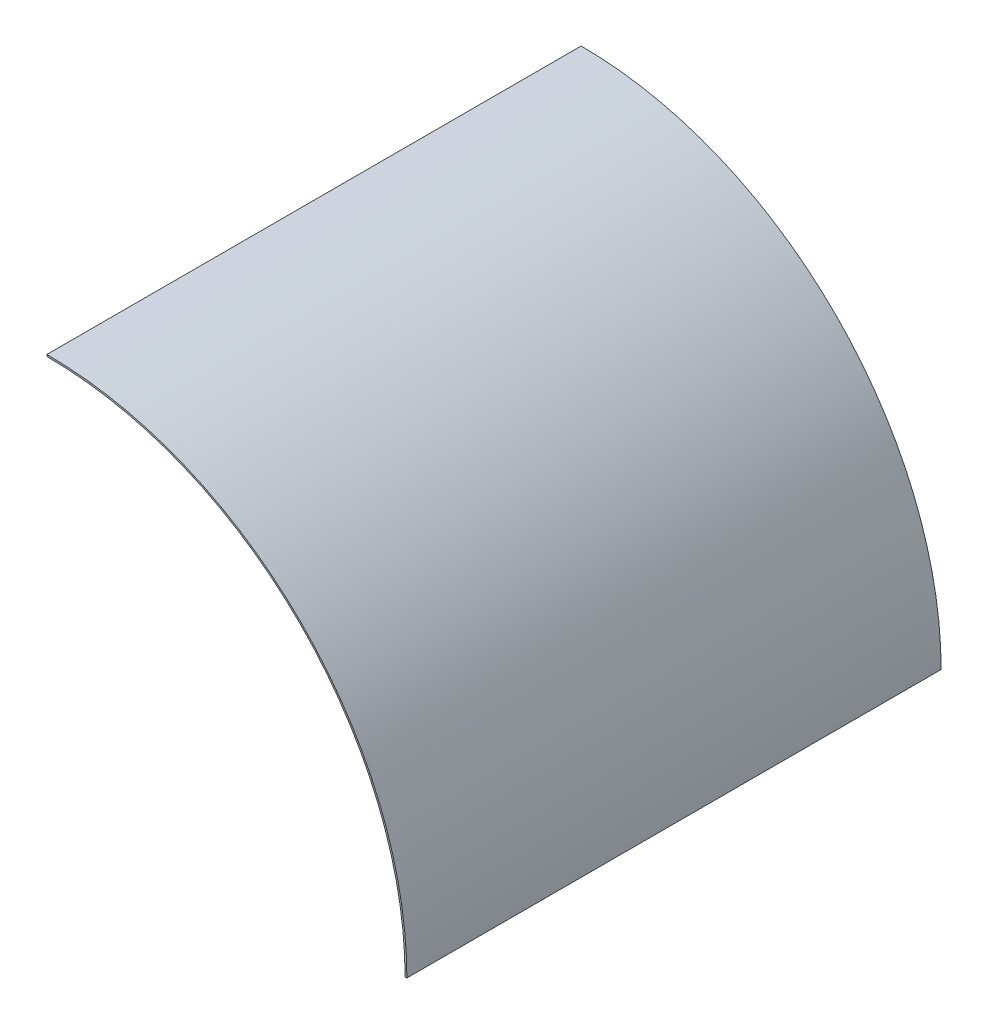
from build123d import *

# Parameters (mm, degrees)
BOSS_EXTRUDE1_DEPTH = 3000


with BuildPart() as part:
    # Sketch1 → Boss-Extrude1 (new body)
    with BuildSketch(Plane.XY):
        with BuildLine():
            Line((0, 2021.5), (0, 2011.5))
            ThreePointArc((0, 2011.5), (1422.345290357, 1422.345290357), (2011.5, 0))
            Line((2011.5, 0), (2021.5, 0))
            ThreePointArc((2021.5, 0), (1429.416358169, 1429.416358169), (0, 2021.5))
        make_face()
    extrude(amount=-BOSS_EXTRUDE1_DEPTH)


solid = part.part
